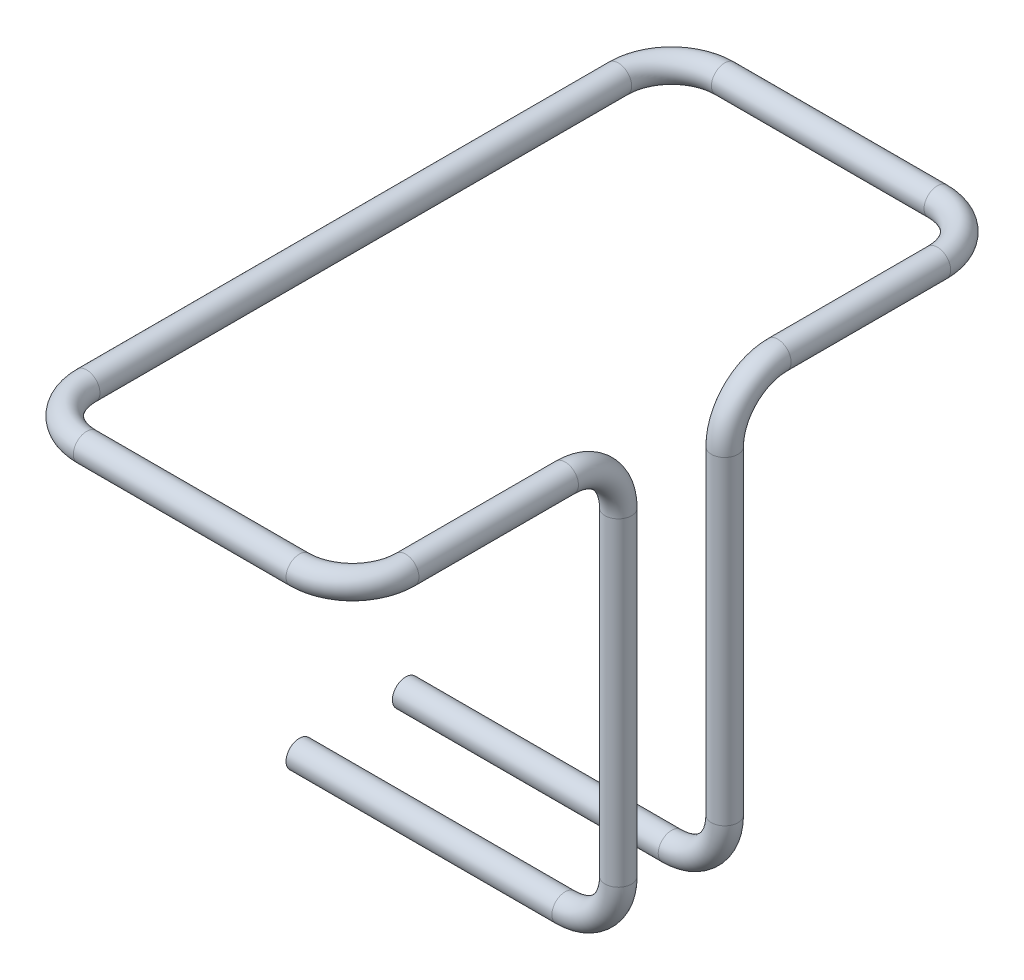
from build123d import *

# Parameters (mm, degrees)
SWEPT_PROFILE_R = 3.175


with BuildPart() as part:
    # Sweep1: sweep along a curve in space
    with BuildLine() as sweep1_path:
        Line((0, 0, 0), (63.5, 0, 0))
        ThreePointArc((63.5, 0, 0), (72.480256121, 3.719743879, 0), (76.2, 12.7, 0))
        Line((76.2, 12.7, 0), (76.2, 88.9, 0))
        ThreePointArc((76.2, 88.9, 0), (76.2, 97.880256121, -3.719743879), (76.2, 101.6, -12.7))
        Line((76.2, 101.6, -12.7), (76.2, 101.6, -50.8))
        ThreePointArc((76.2, 101.6, -50.8), (72.480256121, 101.6, -59.780256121), (63.5, 101.6, -63.5))
        Line((63.5, 101.6, -63.5), (12.7, 101.6, -63.5))
        ThreePointArc((12.7, 101.6, -63.5), (3.719743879, 101.6, -59.780256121), (0, 101.6, -50.8))
        Line((0, 101.6, -50.8), (0, 101.6, 76.2))
        ThreePointArc((0, 101.6, 76.2), (3.719743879, 101.6, 85.180256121), (12.7, 101.6, 88.9))
        Line((12.7, 101.6, 88.9), (63.5, 101.6, 88.9))
        ThreePointArc((63.5, 101.6, 88.9), (72.480256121, 101.6, 85.180256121), (76.2, 101.6, 76.2))
        Line((76.2, 101.6, 76.2), (76.2, 101.6, 38.1))
        ThreePointArc((76.2, 101.6, 38.1), (76.2, 97.880256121, 29.119743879), (76.2, 88.9, 25.4))
        Line((76.2, 88.9, 25.4), (76.2, 12.7, 25.4))
        ThreePointArc((76.2, 12.7, 25.4), (72.480256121, 3.719743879, 25.4), (63.5, 0, 25.4))
        Line((63.5, 0, 25.4), (0, 0, 25.4))
    # SWEPT PROFILE → Sweep1 (sweep)
    with BuildSketch(Plane(origin=(0, 0, 0), x_dir=(0, 0, -1), z_dir=(1, 0, 0))):
        Circle(SWEPT_PROFILE_R)
    sweep(path=sweep1_path.line)


solid = part.part
